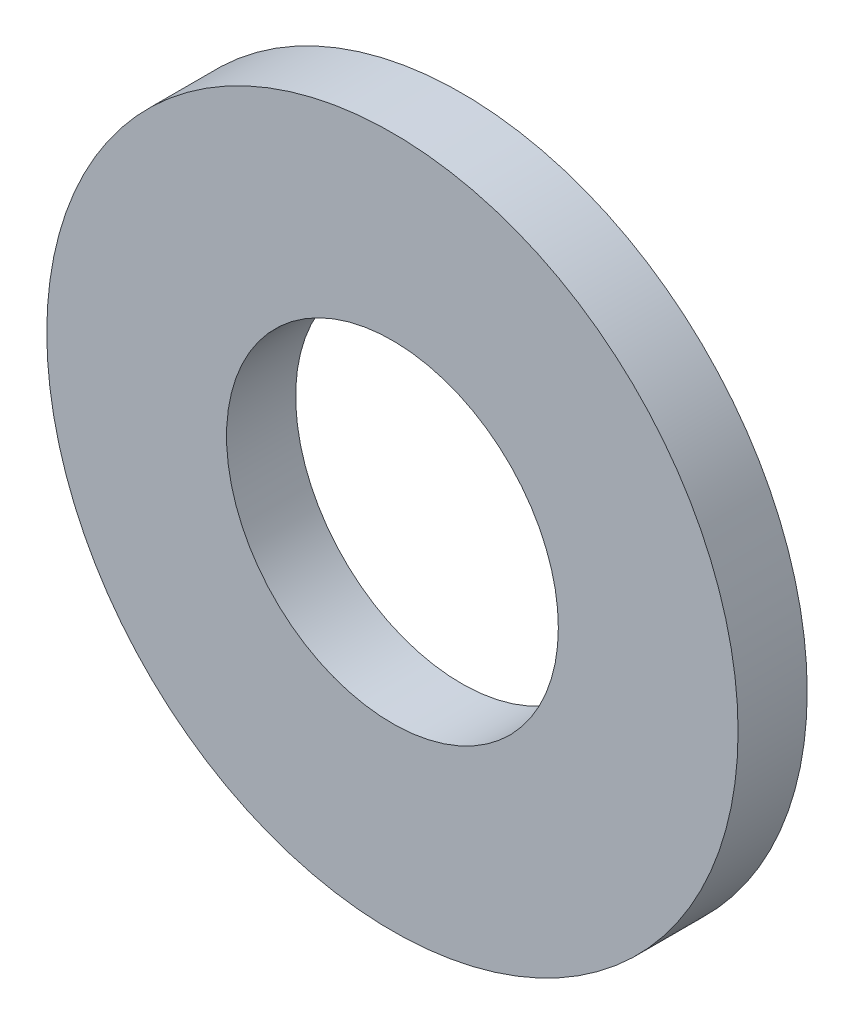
from build123d import *

# Parameters (mm, degrees)
ESQUISSE1_R      = 12.5
ESQUISSE1_R_2    = 6
EXTRUSION1_DEPTH = 2.5


with BuildPart() as part:
    # Esquisse1 → Extrusion1 (new body)
    with BuildSketch(Plane.XY):
        Circle(ESQUISSE1_R)
        Circle(ESQUISSE1_R_2, mode=Mode.SUBTRACT)
    extrude(amount=EXTRUSION1_DEPTH)


solid = part.part
